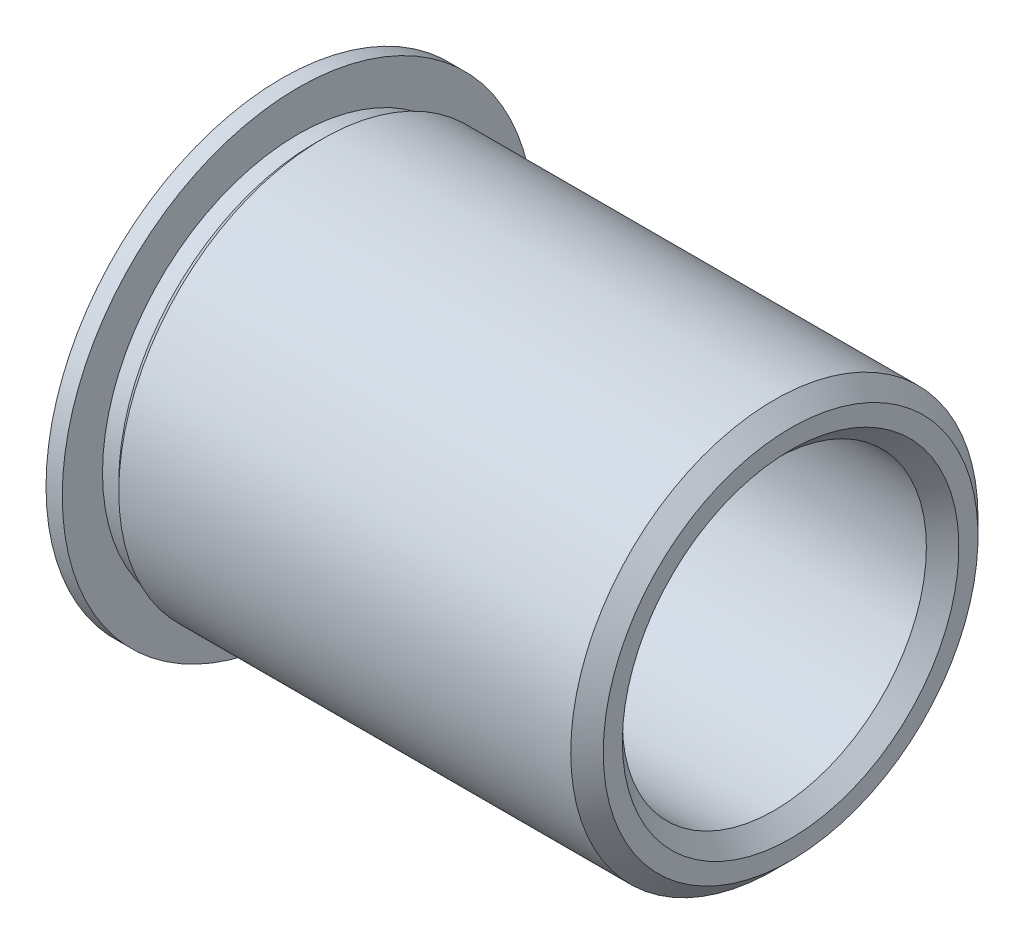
ISO-10303-21;
HEADER;
FILE_DESCRIPTION(('STEP AP214'),'2;1');
FILE_NAME('part.step','',(''),(''),'','','');
FILE_SCHEMA(('AUTOMOTIVE_DESIGN { 1 0 10303 214 1 1 1 1 }'));
ENDSEC;
DATA;
#1=APPLICATION_CONTEXT('core data for automotive mechanical design processes');
#2=APPLICATION_PROTOCOL_DEFINITION('international standard','automotive_design',2000,#1);
#3=PRODUCT_CONTEXT('',#1,'mechanical');
#4=PRODUCT('Part','Part','',(#3));
#5=PRODUCT_RELATED_PRODUCT_CATEGORY('part','',(#4));
#6=PRODUCT_DEFINITION_FORMATION('','',#4);
#7=PRODUCT_DEFINITION_CONTEXT('part definition',#1,'design');
#8=PRODUCT_DEFINITION('design','',#6,#7);
#9=PRODUCT_DEFINITION_SHAPE('','',#8);
#10=(LENGTH_UNIT() NAMED_UNIT(*) SI_UNIT(.MILLI.,.METRE.));
#11=(NAMED_UNIT(*) PLANE_ANGLE_UNIT() SI_UNIT($,.RADIAN.));
#12=(NAMED_UNIT(*) SI_UNIT($,.STERADIAN.) SOLID_ANGLE_UNIT());
#13=UNCERTAINTY_MEASURE_WITH_UNIT(LENGTH_MEASURE(1.E-05),#10,'distance_accuracy_value','');
#14=(GEOMETRIC_REPRESENTATION_CONTEXT(3) GLOBAL_UNCERTAINTY_ASSIGNED_CONTEXT((#13)) GLOBAL_UNIT_ASSIGNED_CONTEXT((#10,
#11,#12)) REPRESENTATION_CONTEXT('',''));
#15=CARTESIAN_POINT('',(0.,0.,0.));
#16=DIRECTION('',(0.,0.,1.));
#17=DIRECTION('',(1.,0.,0.));
#18=AXIS2_PLACEMENT_3D('',#15,#16,#17);
#19=CARTESIAN_POINT('',(-45.0910828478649,95.4400873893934,0.));
#20=DIRECTION('',(-1.,0.,0.));
#21=DIRECTION('',(0.,0.,1.));
#22=AXIS2_PLACEMENT_3D('',#19,#20,#21);
#23=PLANE('',#22);
#24=CARTESIAN_POINT('',(-45.0910828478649,95.4400873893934,0.));
#25=DIRECTION('',(-1.,0.,0.));
#26=DIRECTION('',(0.,0.,1.));
#27=AXIS2_PLACEMENT_3D('',#24,#25,#26);
#28=CIRCLE('',#27,2.6289);
#29=CARTESIAN_POINT('',(-45.0910828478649,95.4400873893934,2.6289));
#30=VERTEX_POINT('',#29);
#31=EDGE_CURVE('E10',#30,#30,#28,.T.);
#32=ORIENTED_EDGE('',*,*,#31,.T.);
#33=EDGE_LOOP('',(#32));
#34=FACE_BOUND('',#33,.T.);
#35=CARTESIAN_POINT('',(-45.0910828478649,95.4400873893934,0.));
#36=DIRECTION('',(-1.,0.,0.));
#37=DIRECTION('',(0.,0.,1.));
#38=AXIS2_PLACEMENT_3D('',#35,#36,#37);
#39=CIRCLE('',#38,2.92735);
#40=CARTESIAN_POINT('',(-45.0910828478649,95.4400873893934,2.92735));
#41=VERTEX_POINT('',#40);
#42=EDGE_CURVE('E52',#41,#41,#39,.T.);
#43=ORIENTED_EDGE('',*,*,#42,.F.);
#44=EDGE_LOOP('',(#43));
#45=FACE_BOUND('',#44,.T.);
#46=ADVANCED_FACE('F32',(#34,#45),#23,.F.);
#47=CARTESIAN_POINT('',(-45.0910828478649,95.4400873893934,0.));
#48=DIRECTION('',(-1.,0.,0.));
#49=DIRECTION('',(0.,0.,1.));
#50=AXIS2_PLACEMENT_3D('',#47,#48,#49);
#51=CONICAL_SURFACE('',#50,2.92735,0.785398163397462);
#52=CARTESIAN_POINT('',(-45.3450828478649,95.4400873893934,0.));
#53=DIRECTION('',(-1.,0.,0.));
#54=DIRECTION('',(0.,0.,1.));
#55=AXIS2_PLACEMENT_3D('',#52,#53,#54);
#56=CIRCLE('',#55,3.18135);
#57=CARTESIAN_POINT('',(-45.3450828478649,95.4400873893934,3.18135));
#58=VERTEX_POINT('',#57);
#59=EDGE_CURVE('E55',#58,#58,#56,.T.);
#60=ORIENTED_EDGE('',*,*,#59,.F.);
#61=EDGE_LOOP('',(#60));
#62=FACE_BOUND('',#61,.T.);
#63=ORIENTED_EDGE('',*,*,#42,.T.);
#64=EDGE_LOOP('',(#63));
#65=FACE_BOUND('',#64,.T.);
#66=ADVANCED_FACE('F103',(#62,#65),#51,.T.);
#67=CARTESIAN_POINT('',(-53.0412828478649,95.4400873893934,0.));
#68=DIRECTION('',(-1.,0.,0.));
#69=DIRECTION('',(0.,0.,1.));
#70=AXIS2_PLACEMENT_3D('',#67,#68,#69);
#71=CYLINDRICAL_SURFACE('',#70,3.18135);
#72=CARTESIAN_POINT('',(-52.406282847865,95.4400873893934,0.));
#73=DIRECTION('',(-1.,0.,0.));
#74=DIRECTION('',(0.,0.,1.));
#75=AXIS2_PLACEMENT_3D('',#72,#73,#74);
#76=CIRCLE('',#75,3.18135);
#77=CARTESIAN_POINT('',(-52.406282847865,95.4400873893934,3.18135));
#78=VERTEX_POINT('',#77);
#79=EDGE_CURVE('E58',#78,#78,#76,.T.);
#80=ORIENTED_EDGE('',*,*,#79,.F.);
#81=EDGE_LOOP('',(#80));
#82=FACE_BOUND('',#81,.T.);
#83=ORIENTED_EDGE('',*,*,#59,.T.);
#84=EDGE_LOOP('',(#83));
#85=FACE_BOUND('',#84,.T.);
#86=ADVANCED_FACE('F97',(#82,#85),#71,.T.);
#87=CARTESIAN_POINT('',(-52.406282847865,95.4400873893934,0.));
#88=DIRECTION('',(1.,0.,0.));
#89=DIRECTION('',(0.,0.,-1.));
#90=AXIS2_PLACEMENT_3D('',#87,#88,#89);
#91=CONICAL_SURFACE('',#90,3.18135,0.785398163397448);
#92=CARTESIAN_POINT('',(-52.533282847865,95.4400873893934,0.));
#93=DIRECTION('',(-1.,0.,0.));
#94=DIRECTION('',(0.,0.,1.));
#95=AXIS2_PLACEMENT_3D('',#92,#93,#94);
#96=CIRCLE('',#95,3.05435);
#97=CARTESIAN_POINT('',(-52.533282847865,95.4400873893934,3.05435));
#98=VERTEX_POINT('',#97);
#99=EDGE_CURVE('E61',#98,#98,#96,.T.);
#100=ORIENTED_EDGE('',*,*,#99,.F.);
#101=EDGE_LOOP('',(#100));
#102=FACE_BOUND('',#101,.T.);
#103=ORIENTED_EDGE('',*,*,#79,.T.);
#104=EDGE_LOOP('',(#103));
#105=FACE_BOUND('',#104,.T.);
#106=ADVANCED_FACE('F91',(#102,#105),#91,.T.);
#107=CARTESIAN_POINT('',(-53.0412828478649,95.4400873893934,0.));
#108=DIRECTION('',(-1.,0.,0.));
#109=DIRECTION('',(0.,0.,1.));
#110=AXIS2_PLACEMENT_3D('',#107,#108,#109);
#111=CYLINDRICAL_SURFACE('',#110,3.05435);
#112=CARTESIAN_POINT('',(-52.787282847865,95.4400873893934,0.));
#113=DIRECTION('',(-1.,0.,0.));
#114=DIRECTION('',(0.,0.,1.));
#115=AXIS2_PLACEMENT_3D('',#112,#113,#114);
#116=CIRCLE('',#115,3.05435);
#117=CARTESIAN_POINT('',(-52.787282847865,95.4400873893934,3.05435));
#118=VERTEX_POINT('',#117);
#119=EDGE_CURVE('E64',#118,#118,#116,.T.);
#120=ORIENTED_EDGE('',*,*,#119,.F.);
#121=EDGE_LOOP('',(#120));
#122=FACE_BOUND('',#121,.T.);
#123=ORIENTED_EDGE('',*,*,#99,.T.);
#124=EDGE_LOOP('',(#123));
#125=FACE_BOUND('',#124,.T.);
#126=ADVANCED_FACE('F85',(#122,#125),#111,.T.);
#127=CARTESIAN_POINT('',(-52.787282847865,98.4944373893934,0.));
#128=DIRECTION('',(-1.,0.,0.));
#129=DIRECTION('',(0.,0.,1.));
#130=AXIS2_PLACEMENT_3D('',#127,#128,#129);
#131=PLANE('',#130);
#132=CARTESIAN_POINT('',(-52.787282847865,95.4400873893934,0.));
#133=DIRECTION('',(-1.,0.,0.));
#134=DIRECTION('',(0.,0.,1.));
#135=AXIS2_PLACEMENT_3D('',#132,#133,#134);
#136=CIRCLE('',#135,3.68299999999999);
#137=CARTESIAN_POINT('',(-52.787282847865,95.4400873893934,3.68299999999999));
#138=VERTEX_POINT('',#137);
#139=EDGE_CURVE('E67',#138,#138,#136,.T.);
#140=ORIENTED_EDGE('',*,*,#139,.F.);
#141=EDGE_LOOP('',(#140));
#142=FACE_BOUND('',#141,.T.);
#143=ORIENTED_EDGE('',*,*,#119,.T.);
#144=EDGE_LOOP('',(#143));
#145=FACE_BOUND('',#144,.T.);
#146=ADVANCED_FACE('F79',(#142,#145),#131,.F.);
#147=CARTESIAN_POINT('',(-53.0412828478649,95.4400873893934,0.));
#148=DIRECTION('',(-1.,0.,0.));
#149=DIRECTION('',(0.,0.,1.));
#150=AXIS2_PLACEMENT_3D('',#147,#148,#149);
#151=CYLINDRICAL_SURFACE('',#150,3.683);
#152=CARTESIAN_POINT('',(-53.0412828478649,95.4400873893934,0.));
#153=DIRECTION('',(-1.,0.,0.));
#154=DIRECTION('',(0.,0.,1.));
#155=AXIS2_PLACEMENT_3D('',#152,#153,#154);
#156=CIRCLE('',#155,3.68300000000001);
#157=CARTESIAN_POINT('',(-53.0412828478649,95.4400873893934,3.68300000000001));
#158=VERTEX_POINT('',#157);
#159=EDGE_CURVE('E70',#158,#158,#156,.T.);
#160=ORIENTED_EDGE('',*,*,#159,.F.);
#161=EDGE_LOOP('',(#160));
#162=FACE_BOUND('',#161,.T.);
#163=ORIENTED_EDGE('',*,*,#139,.T.);
#164=EDGE_LOOP('',(#163));
#165=FACE_BOUND('',#164,.T.);
#166=ADVANCED_FACE('F76',(#162,#165),#151,.T.);
#167=CARTESIAN_POINT('',(-53.0412828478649,95.4400873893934,0.));
#168=DIRECTION('',(1.,0.,0.));
#169=DIRECTION('',(0.,0.,-1.));
#170=AXIS2_PLACEMENT_3D('',#167,#168,#169);
#171=PLANE('',#170);
#172=CARTESIAN_POINT('',(-53.0412828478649,95.4400873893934,0.));
#173=DIRECTION('',(1.,0.,0.));
#174=DIRECTION('',(0.,0.,-1.));
#175=AXIS2_PLACEMENT_3D('',#172,#173,#174);
#176=CIRCLE('',#175,2.6289);
#177=CARTESIAN_POINT('',(-53.0412828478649,95.4400873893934,-2.6289));
#178=VERTEX_POINT('',#177);
#179=EDGE_CURVE('E47',#178,#178,#176,.T.);
#180=ORIENTED_EDGE('',*,*,#179,.T.);
#181=EDGE_LOOP('',(#180));
#182=FACE_BOUND('',#181,.T.);
#183=ORIENTED_EDGE('',*,*,#159,.T.);
#184=EDGE_LOOP('',(#183));
#185=FACE_BOUND('',#184,.T.);
#186=ADVANCED_FACE('F74',(#182,#185),#171,.F.);
#187=CARTESIAN_POINT('',(-53.0412828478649,95.4400873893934,0.));
#188=DIRECTION('',(1.,0.,0.));
#189=DIRECTION('',(0.,0.,-1.));
#190=AXIS2_PLACEMENT_3D('',#187,#188,#189);
#191=CYLINDRICAL_SURFACE('',#190,2.3749);
#192=CARTESIAN_POINT('',(-45.345082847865,95.4400873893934,0.));
#193=DIRECTION('',(-1.,0.,0.));
#194=DIRECTION('',(0.,0.,1.));
#195=AXIS2_PLACEMENT_3D('',#192,#193,#194);
#196=CIRCLE('',#195,2.3749);
#197=CARTESIAN_POINT('',(-45.345082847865,95.4400873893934,2.3749));
#198=VERTEX_POINT('',#197);
#199=EDGE_CURVE('E39',#198,#198,#196,.F.);
#200=ORIENTED_EDGE('',*,*,#199,.T.);
#201=EDGE_LOOP('',(#200));
#202=FACE_BOUND('',#201,.T.);
#203=CARTESIAN_POINT('',(-52.787282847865,95.4400873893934,0.));
#204=DIRECTION('',(1.,0.,0.));
#205=DIRECTION('',(0.,0.,-1.));
#206=AXIS2_PLACEMENT_3D('',#203,#204,#205);
#207=CIRCLE('',#206,2.3749);
#208=CARTESIAN_POINT('',(-52.787282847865,95.4400873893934,-2.3749));
#209=VERTEX_POINT('',#208);
#210=EDGE_CURVE('E43',#209,#209,#207,.F.);
#211=ORIENTED_EDGE('',*,*,#210,.T.);
#212=EDGE_LOOP('',(#211));
#213=FACE_BOUND('',#212,.T.);
#214=ADVANCED_FACE('F118',(#202,#213),#191,.F.);
#215=CARTESIAN_POINT('',(-53.0412828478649,95.4400873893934,0.));
#216=DIRECTION('',(-1.,0.,0.));
#217=DIRECTION('',(0.,0.,1.));
#218=AXIS2_PLACEMENT_3D('',#215,#216,#217);
#219=CONICAL_SURFACE('',#218,2.6289,0.785398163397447);
#220=ORIENTED_EDGE('',*,*,#210,.F.);
#221=EDGE_LOOP('',(#220));
#222=FACE_BOUND('',#221,.T.);
#223=ORIENTED_EDGE('',*,*,#179,.F.);
#224=EDGE_LOOP('',(#223));
#225=FACE_BOUND('',#224,.T.);
#226=ADVANCED_FACE('F116',(#222,#225),#219,.F.);
#227=CARTESIAN_POINT('',(-45.345082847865,95.4400873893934,0.));
#228=DIRECTION('',(1.,0.,0.));
#229=DIRECTION('',(0.,0.,-1.));
#230=AXIS2_PLACEMENT_3D('',#227,#228,#229);
#231=CONICAL_SURFACE('',#230,2.3749,0.785398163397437);
#232=ORIENTED_EDGE('',*,*,#31,.F.);
#233=EDGE_LOOP('',(#232));
#234=FACE_BOUND('',#233,.T.);
#235=ORIENTED_EDGE('',*,*,#199,.F.);
#236=EDGE_LOOP('',(#235));
#237=FACE_BOUND('',#236,.T.);
#238=ADVANCED_FACE('F34',(#234,#237),#231,.F.);
#239=CLOSED_SHELL('',(#46,#66,#86,#106,#126,#146,#166,#186,#214,#226,#238));
#240=MANIFOLD_SOLID_BREP('B2',#239);
#241=ADVANCED_BREP_SHAPE_REPRESENTATION('',(#18,#240),#14);
#242=SHAPE_DEFINITION_REPRESENTATION(#9,#241);
ENDSEC;
END-ISO-10303-21;
